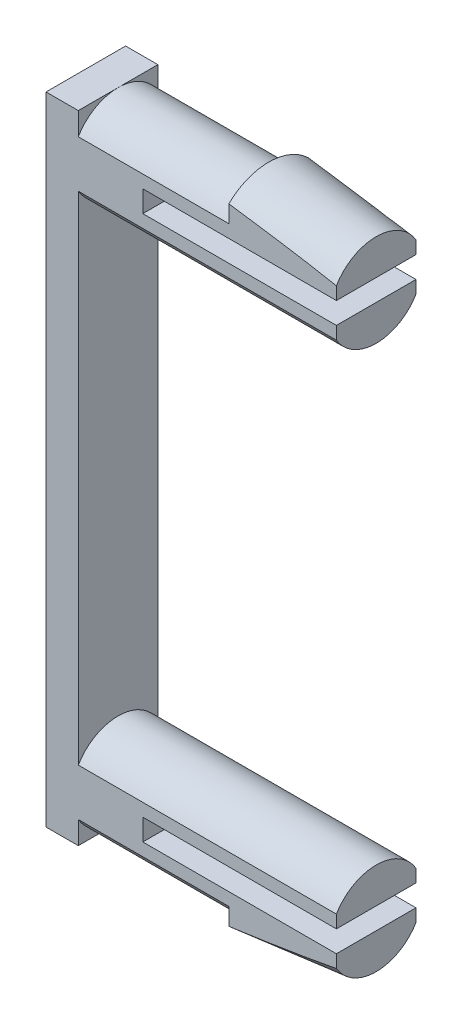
ISO-10303-21;
HEADER;
FILE_DESCRIPTION(('STEP AP214'),'2;1');
FILE_NAME('part.step','',(''),(''),'','','');
FILE_SCHEMA(('AUTOMOTIVE_DESIGN { 1 0 10303 214 1 1 1 1 }'));
ENDSEC;
DATA;
#1=APPLICATION_CONTEXT('core data for automotive mechanical design processes');
#2=APPLICATION_PROTOCOL_DEFINITION('international standard','automotive_design',2000,#1);
#3=PRODUCT_CONTEXT('',#1,'mechanical');
#4=PRODUCT('Part','Part','',(#3));
#5=PRODUCT_RELATED_PRODUCT_CATEGORY('part','',(#4));
#6=PRODUCT_DEFINITION_FORMATION('','',#4);
#7=PRODUCT_DEFINITION_CONTEXT('part definition',#1,'design');
#8=PRODUCT_DEFINITION('design','',#6,#7);
#9=PRODUCT_DEFINITION_SHAPE('','',#8);
#10=(LENGTH_UNIT() NAMED_UNIT(*) SI_UNIT(.MILLI.,.METRE.));
#11=(NAMED_UNIT(*) PLANE_ANGLE_UNIT() SI_UNIT($,.RADIAN.));
#12=(NAMED_UNIT(*) SI_UNIT($,.STERADIAN.) SOLID_ANGLE_UNIT());
#13=UNCERTAINTY_MEASURE_WITH_UNIT(LENGTH_MEASURE(1.E-05),#10,'distance_accuracy_value','');
#14=(GEOMETRIC_REPRESENTATION_CONTEXT(3) GLOBAL_UNCERTAINTY_ASSIGNED_CONTEXT((#13)) GLOBAL_UNIT_ASSIGNED_CONTEXT((#10,
#11,#12)) REPRESENTATION_CONTEXT('',''));
#15=CARTESIAN_POINT('',(0.,0.,0.));
#16=DIRECTION('',(0.,0.,1.));
#17=DIRECTION('',(1.,0.,0.));
#18=AXIS2_PLACEMENT_3D('',#15,#16,#17);
#19=CARTESIAN_POINT('',(12.75,-12.65,12.65));
#20=DIRECTION('',(1.,0.,0.));
#21=DIRECTION('',(0.,0.,-1.));
#22=AXIS2_PLACEMENT_3D('',#19,#20,#21);
#23=PLANE('',#22);
#24=DIRECTION('',(0.,0.,-1.));
#25=VECTOR('',#24,1.);
#26=CARTESIAN_POINT('',(12.75,-12.15,1.85100000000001));
#27=LINE('',#26,#25);
#28=CARTESIAN_POINT('',(12.75,-12.15,1.85));
#29=VERTEX_POINT('',#28);
#30=CARTESIAN_POINT('',(12.75,-12.15,-1.84999999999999));
#31=VERTEX_POINT('',#30);
#32=EDGE_CURVE('E215',#29,#31,#27,.T.);
#33=ORIENTED_EDGE('',*,*,#32,.T.);
#34=DIRECTION('',(0.,-1.,0.));
#35=VECTOR('',#34,1.);
#36=CARTESIAN_POINT('',(12.75,0.,-1.85));
#37=LINE('',#36,#35);
#38=CARTESIAN_POINT('',(12.75,-11.5545548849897,-1.84999999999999));
#39=VERTEX_POINT('',#38);
#40=EDGE_CURVE('E279',#39,#31,#37,.T.);
#41=ORIENTED_EDGE('',*,*,#40,.F.);
#42=CARTESIAN_POINT('',(12.75,-12.65,0.));
#43=DIRECTION('',(-1.,0.,0.));
#44=DIRECTION('',(0.,0.,1.));
#45=AXIS2_PLACEMENT_3D('',#42,#43,#44);
#46=CIRCLE('',#45,2.15);
#47=CARTESIAN_POINT('',(12.75,-11.5545548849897,1.85));
#48=VERTEX_POINT('',#47);
#49=EDGE_CURVE('E328',#48,#39,#46,.T.);
#50=ORIENTED_EDGE('',*,*,#49,.F.);
#51=DIRECTION('',(0.,-1.,0.));
#52=VECTOR('',#51,1.);
#53=CARTESIAN_POINT('',(12.75,0.,1.85));
#54=LINE('',#53,#52);
#55=EDGE_CURVE('E228',#48,#29,#54,.T.);
#56=ORIENTED_EDGE('',*,*,#55,.T.);
#57=EDGE_LOOP('',(#33,#41,#50,#56));
#58=FACE_BOUND('',#57,.T.);
#59=ADVANCED_FACE('F35',(#58),#23,.T.);
#60=CARTESIAN_POINT('',(12.75,12.65,-12.65));
#61=DIRECTION('',(1.,0.,0.));
#62=DIRECTION('',(0.,1.,0.));
#63=AXIS2_PLACEMENT_3D('',#60,#61,#62);
#64=PLANE('',#63);
#65=DIRECTION('',(0.,0.,-1.));
#66=VECTOR('',#65,1.);
#67=CARTESIAN_POINT('',(12.75,13.15,1.851));
#68=LINE('',#67,#66);
#69=CARTESIAN_POINT('',(12.75,13.15,1.85));
#70=VERTEX_POINT('',#69);
#71=CARTESIAN_POINT('',(12.75,13.15,-1.85));
#72=VERTEX_POINT('',#71);
#73=EDGE_CURVE('E431',#70,#72,#68,.T.);
#74=ORIENTED_EDGE('',*,*,#73,.T.);
#75=CARTESIAN_POINT('',(12.75,13.7454451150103,-1.85));
#76=VERTEX_POINT('',#75);
#77=EDGE_CURVE('E394',#76,#72,#37,.T.);
#78=ORIENTED_EDGE('',*,*,#77,.F.);
#79=CARTESIAN_POINT('',(12.75,12.65,0.));
#80=DIRECTION('',(-1.,0.,0.));
#81=DIRECTION('',(0.,-1.,0.));
#82=AXIS2_PLACEMENT_3D('',#79,#80,#81);
#83=CIRCLE('',#82,2.15);
#84=CARTESIAN_POINT('',(12.75,13.7454451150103,1.85));
#85=VERTEX_POINT('',#84);
#86=EDGE_CURVE('E334',#85,#76,#83,.T.);
#87=ORIENTED_EDGE('',*,*,#86,.F.);
#88=EDGE_CURVE('E233',#85,#70,#54,.T.);
#89=ORIENTED_EDGE('',*,*,#88,.T.);
#90=EDGE_LOOP('',(#74,#78,#87,#89));
#91=FACE_BOUND('',#90,.T.);
#92=ADVANCED_FACE('F430',(#91),#64,.T.);
#93=CARTESIAN_POINT('',(0.75,0.,2.25));
#94=DIRECTION('',(1.,0.,0.));
#95=DIRECTION('',(0.,1.,0.));
#96=AXIS2_PLACEMENT_3D('',#93,#94,#95);
#97=PLANE('',#96);
#98=DIRECTION('',(0.,1.,0.));
#99=VECTOR('',#98,1.);
#100=CARTESIAN_POINT('',(0.75,0.,1.85));
#101=LINE('',#100,#99);
#102=CARTESIAN_POINT('',(0.750000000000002,-14.8,1.85));
#103=VERTEX_POINT('',#102);
#104=CARTESIAN_POINT('',(0.750000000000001,-13.7454451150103,1.85));
#105=VERTEX_POINT('',#104);
#106=EDGE_CURVE('E259',#103,#105,#101,.T.);
#107=ORIENTED_EDGE('',*,*,#106,.F.);
#108=DIRECTION('',(0.,0.,-1.));
#109=VECTOR('',#108,1.);
#110=CARTESIAN_POINT('',(0.750000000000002,-14.8,2.25));
#111=LINE('',#110,#109);
#112=CARTESIAN_POINT('',(0.750000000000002,-14.8,0.));
#113=VERTEX_POINT('',#112);
#114=EDGE_CURVE('E346',#103,#113,#111,.T.);
#115=ORIENTED_EDGE('',*,*,#114,.T.);
#116=CARTESIAN_POINT('',(0.750000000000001,-12.65,0.));
#117=DIRECTION('',(-1.,0.,0.));
#118=DIRECTION('',(0.,0.,1.));
#119=AXIS2_PLACEMENT_3D('',#116,#117,#118);
#120=CIRCLE('',#119,2.15);
#121=EDGE_CURVE('E325',#113,#105,#120,.T.);
#122=ORIENTED_EDGE('',*,*,#121,.T.);
#123=EDGE_LOOP('',(#107,#115,#122));
#124=FACE_BOUND('',#123,.T.);
#125=ADVANCED_FACE('F486',(#124),#97,.T.);
#126=CARTESIAN_POINT('',(0.750000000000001,-11.5545548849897,1.85));
#127=VERTEX_POINT('',#126);
#128=CARTESIAN_POINT('',(0.749999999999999,11.5545548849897,1.85));
#129=VERTEX_POINT('',#128);
#130=EDGE_CURVE('E263',#127,#129,#101,.T.);
#131=ORIENTED_EDGE('',*,*,#130,.F.);
#132=CARTESIAN_POINT('',(0.750000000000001,-11.5545548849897,-1.84999999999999));
#133=VERTEX_POINT('',#132);
#134=EDGE_CURVE('E329',#127,#133,#120,.T.);
#135=ORIENTED_EDGE('',*,*,#134,.T.);
#136=DIRECTION('',(0.,1.,0.));
#137=VECTOR('',#136,1.);
#138=CARTESIAN_POINT('',(0.75,0.,-1.85));
#139=LINE('',#138,#137);
#140=CARTESIAN_POINT('',(0.749999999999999,11.5545548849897,-1.85));
#141=VERTEX_POINT('',#140);
#142=EDGE_CURVE('E378',#133,#141,#139,.T.);
#143=ORIENTED_EDGE('',*,*,#142,.T.);
#144=CARTESIAN_POINT('',(0.749999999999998,12.65,0.));
#145=DIRECTION('',(-1.,0.,0.));
#146=DIRECTION('',(0.,-1.,0.));
#147=AXIS2_PLACEMENT_3D('',#144,#145,#146);
#148=CIRCLE('',#147,2.15000000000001);
#149=EDGE_CURVE('E340',#141,#129,#148,.T.);
#150=ORIENTED_EDGE('',*,*,#149,.T.);
#151=EDGE_LOOP('',(#131,#135,#143,#150));
#152=FACE_BOUND('',#151,.T.);
#153=ADVANCED_FACE('F413',(#152),#97,.T.);
#154=CARTESIAN_POINT('',(0.749999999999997,12.65,0.));
#155=DIRECTION('',(-1.,0.,0.));
#156=DIRECTION('',(0.,-1.,0.));
#157=AXIS2_PLACEMENT_3D('',#154,#155,#156);
#158=CYLINDRICAL_SURFACE('',#157,2.15);
#159=DIRECTION('',(-1.,0.,0.));
#160=VECTOR('',#159,1.);
#161=CARTESIAN_POINT('',(0.749999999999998,11.5545548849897,1.85));
#162=LINE('',#161,#160);
#163=CARTESIAN_POINT('',(12.75,11.5545548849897,1.85));
#164=VERTEX_POINT('',#163);
#165=EDGE_CURVE('E265',#129,#164,#162,.F.);
#166=ORIENTED_EDGE('',*,*,#165,.F.);
#167=ORIENTED_EDGE('',*,*,#149,.F.);
#168=DIRECTION('',(-1.,0.,0.));
#169=VECTOR('',#168,1.);
#170=CARTESIAN_POINT('',(0.749999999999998,11.5545548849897,-1.85));
#171=LINE('',#170,#169);
#172=CARTESIAN_POINT('',(12.75,11.5545548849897,-1.85));
#173=VERTEX_POINT('',#172);
#174=EDGE_CURVE('E376',#141,#173,#171,.F.);
#175=ORIENTED_EDGE('',*,*,#174,.T.);
#176=CARTESIAN_POINT('',(12.75,12.65,0.));
#177=DIRECTION('',(-1.,0.,0.));
#178=DIRECTION('',(0.,-1.,0.));
#179=AXIS2_PLACEMENT_3D('',#176,#177,#178);
#180=CIRCLE('',#179,2.15);
#181=EDGE_CURVE('E331',#173,#164,#180,.T.);
#182=ORIENTED_EDGE('',*,*,#181,.T.);
#183=EDGE_LOOP('',(#166,#167,#175,#182));
#184=FACE_BOUND('',#183,.T.);
#185=ADVANCED_FACE('F411',(#184),#158,.T.);
#186=CARTESIAN_POINT('',(0.750000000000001,-12.65,0.));
#187=DIRECTION('',(-1.,0.,0.));
#188=DIRECTION('',(0.,0.,1.));
#189=AXIS2_PLACEMENT_3D('',#186,#187,#188);
#190=CYLINDRICAL_SURFACE('',#189,2.15);
#191=DIRECTION('',(-1.,0.,0.));
#192=VECTOR('',#191,1.);
#193=CARTESIAN_POINT('',(0.750000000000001,-13.7454451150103,1.85));
#194=LINE('',#193,#192);
#195=CARTESIAN_POINT('',(7.75,-13.7454451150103,1.85));
#196=VERTEX_POINT('',#195);
#197=EDGE_CURVE('E257',#105,#196,#194,.F.);
#198=ORIENTED_EDGE('',*,*,#197,.F.);
#199=ORIENTED_EDGE('',*,*,#121,.F.);
#200=CARTESIAN_POINT('',(0.750000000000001,-13.7454451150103,-1.84999999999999));
#201=VERTEX_POINT('',#200);
#202=EDGE_CURVE('E324',#201,#113,#120,.T.);
#203=ORIENTED_EDGE('',*,*,#202,.F.);
#204=DIRECTION('',(-1.,0.,0.));
#205=VECTOR('',#204,1.);
#206=CARTESIAN_POINT('',(0.750000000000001,-13.7454451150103,-1.84999999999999));
#207=LINE('',#206,#205);
#208=CARTESIAN_POINT('',(7.75,-13.7454451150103,-1.84999999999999));
#209=VERTEX_POINT('',#208);
#210=EDGE_CURVE('E387',#201,#209,#207,.F.);
#211=ORIENTED_EDGE('',*,*,#210,.T.);
#212=CARTESIAN_POINT('',(7.75,-12.65,0.));
#213=DIRECTION('',(-1.,0.,0.));
#214=DIRECTION('',(0.,0.,1.));
#215=AXIS2_PLACEMENT_3D('',#212,#213,#214);
#216=CIRCLE('',#215,2.15);
#217=EDGE_CURVE('E316',#209,#196,#216,.T.);
#218=ORIENTED_EDGE('',*,*,#217,.T.);
#219=EDGE_LOOP('',(#198,#199,#203,#211,#218));
#220=FACE_BOUND('',#219,.T.);
#221=ADVANCED_FACE('F493',(#220),#190,.T.);
#222=CARTESIAN_POINT('',(0.750000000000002,-14.8,-1.85));
#223=VERTEX_POINT('',#222);
#224=EDGE_CURVE('E345',#113,#223,#111,.T.);
#225=ORIENTED_EDGE('',*,*,#224,.T.);
#226=EDGE_CURVE('E384',#223,#201,#139,.T.);
#227=ORIENTED_EDGE('',*,*,#226,.T.);
#228=ORIENTED_EDGE('',*,*,#202,.T.);
#229=EDGE_LOOP('',(#225,#227,#228));
#230=FACE_BOUND('',#229,.T.);
#231=ADVANCED_FACE('F37',(#230),#97,.T.);
#232=CARTESIAN_POINT('',(0.749999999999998,13.7454451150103,1.85));
#233=VERTEX_POINT('',#232);
#234=CARTESIAN_POINT('',(0.749999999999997,14.8,1.85));
#235=VERTEX_POINT('',#234);
#236=EDGE_CURVE('E262',#233,#235,#101,.T.);
#237=ORIENTED_EDGE('',*,*,#236,.F.);
#238=CARTESIAN_POINT('',(0.749999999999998,14.8,0.));
#239=VERTEX_POINT('',#238);
#240=EDGE_CURVE('E341',#233,#239,#148,.T.);
#241=ORIENTED_EDGE('',*,*,#240,.T.);
#242=DIRECTION('',(0.,0.,-1.));
#243=VECTOR('',#242,1.);
#244=CARTESIAN_POINT('',(0.749999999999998,14.8,2.25));
#245=LINE('',#244,#243);
#246=EDGE_CURVE('E352',#235,#239,#245,.T.);
#247=ORIENTED_EDGE('',*,*,#246,.F.);
#248=EDGE_LOOP('',(#237,#241,#247));
#249=FACE_BOUND('',#248,.T.);
#250=ADVANCED_FACE('F513',(#249),#97,.T.);
#251=CARTESIAN_POINT('',(0.749999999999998,13.7454451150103,-1.85));
#252=VERTEX_POINT('',#251);
#253=EDGE_CURVE('E337',#239,#252,#148,.T.);
#254=ORIENTED_EDGE('',*,*,#253,.T.);
#255=CARTESIAN_POINT('',(0.749999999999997,14.8,-1.85));
#256=VERTEX_POINT('',#255);
#257=EDGE_CURVE('E313',#252,#256,#139,.T.);
#258=ORIENTED_EDGE('',*,*,#257,.T.);
#259=EDGE_CURVE('E351',#239,#256,#245,.T.);
#260=ORIENTED_EDGE('',*,*,#259,.F.);
#261=EDGE_LOOP('',(#254,#258,#260));
#262=FACE_BOUND('',#261,.T.);
#263=ADVANCED_FACE('F365',(#262),#97,.T.);
#264=CARTESIAN_POINT('',(0.,14.8,2.25));
#265=DIRECTION('',(0.,1.,0.));
#266=DIRECTION('',(-1.,0.,0.));
#267=AXIS2_PLACEMENT_3D('',#264,#265,#266);
#268=PLANE('',#267);
#269=DIRECTION('',(-1.,0.,0.));
#270=VECTOR('',#269,1.);
#271=CARTESIAN_POINT('',(12.75,14.8,1.85));
#272=LINE('',#271,#270);
#273=CARTESIAN_POINT('',(-0.750000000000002,14.8,1.85));
#274=VERTEX_POINT('',#273);
#275=EDGE_CURVE('E243',#235,#274,#272,.T.);
#276=ORIENTED_EDGE('',*,*,#275,.F.);
#277=ORIENTED_EDGE('',*,*,#246,.T.);
#278=ORIENTED_EDGE('',*,*,#259,.T.);
#279=DIRECTION('',(-1.,0.,0.));
#280=VECTOR('',#279,1.);
#281=CARTESIAN_POINT('',(12.75,14.8,-1.85));
#282=LINE('',#281,#280);
#283=CARTESIAN_POINT('',(-0.750000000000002,14.8,-1.85));
#284=VERTEX_POINT('',#283);
#285=EDGE_CURVE('E361',#256,#284,#282,.T.);
#286=ORIENTED_EDGE('',*,*,#285,.T.);
#287=DIRECTION('',(0.,0.,-1.));
#288=VECTOR('',#287,1.);
#289=CARTESIAN_POINT('',(-0.750000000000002,14.8,2.25));
#290=LINE('',#289,#288);
#291=EDGE_CURVE('E350',#274,#284,#290,.T.);
#292=ORIENTED_EDGE('',*,*,#291,.F.);
#293=EDGE_LOOP('',(#276,#277,#278,#286,#292));
#294=FACE_BOUND('',#293,.T.);
#295=ADVANCED_FACE('F359',(#294),#268,.T.);
#296=CARTESIAN_POINT('',(-0.75,0.,2.25));
#297=DIRECTION('',(1.,0.,0.));
#298=DIRECTION('',(0.,1.,0.));
#299=AXIS2_PLACEMENT_3D('',#296,#297,#298);
#300=PLANE('',#299);
#301=DIRECTION('',(0.,0.,-1.));
#302=VECTOR('',#301,1.);
#303=CARTESIAN_POINT('',(-0.749999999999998,-14.8,2.25));
#304=LINE('',#303,#302);
#305=CARTESIAN_POINT('',(-0.749999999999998,-14.8,1.85));
#306=VERTEX_POINT('',#305);
#307=CARTESIAN_POINT('',(-0.749999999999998,-14.8,-1.85));
#308=VERTEX_POINT('',#307);
#309=EDGE_CURVE('E348',#306,#308,#304,.T.);
#310=ORIENTED_EDGE('',*,*,#309,.F.);
#311=DIRECTION('',(0.,-1.,0.));
#312=VECTOR('',#311,1.);
#313=CARTESIAN_POINT('',(-0.75,0.,1.85));
#314=LINE('',#313,#312);
#315=EDGE_CURVE('E229',#274,#306,#314,.T.);
#316=ORIENTED_EDGE('',*,*,#315,.F.);
#317=ORIENTED_EDGE('',*,*,#291,.T.);
#318=DIRECTION('',(0.,-1.,0.));
#319=VECTOR('',#318,1.);
#320=CARTESIAN_POINT('',(-0.75,0.,-1.85));
#321=LINE('',#320,#319);
#322=EDGE_CURVE('E396',#284,#308,#321,.T.);
#323=ORIENTED_EDGE('',*,*,#322,.T.);
#324=EDGE_LOOP('',(#310,#316,#317,#323));
#325=FACE_BOUND('',#324,.T.);
#326=ADVANCED_FACE('F506',(#325),#300,.F.);
#327=CARTESIAN_POINT('',(0.,-14.8,2.25));
#328=DIRECTION('',(0.,1.,0.));
#329=DIRECTION('',(0.,0.,1.));
#330=AXIS2_PLACEMENT_3D('',#327,#328,#329);
#331=PLANE('',#330);
#332=ORIENTED_EDGE('',*,*,#114,.F.);
#333=DIRECTION('',(-1.,0.,0.));
#334=VECTOR('',#333,1.);
#335=CARTESIAN_POINT('',(12.75,-14.8,1.85));
#336=LINE('',#335,#334);
#337=EDGE_CURVE('E247',#103,#306,#336,.T.);
#338=ORIENTED_EDGE('',*,*,#337,.T.);
#339=ORIENTED_EDGE('',*,*,#309,.T.);
#340=DIRECTION('',(-1.,0.,0.));
#341=VECTOR('',#340,1.);
#342=CARTESIAN_POINT('',(12.75,-14.8,-1.85));
#343=LINE('',#342,#341);
#344=EDGE_CURVE('E392',#223,#308,#343,.T.);
#345=ORIENTED_EDGE('',*,*,#344,.F.);
#346=ORIENTED_EDGE('',*,*,#224,.F.);
#347=EDGE_LOOP('',(#332,#338,#339,#345,#346));
#348=FACE_BOUND('',#347,.T.);
#349=ADVANCED_FACE('F503',(#348),#331,.F.);
#350=CARTESIAN_POINT('',(12.75,12.65,0.));
#351=DIRECTION('',(-1.,0.,0.));
#352=DIRECTION('',(0.,-1.,0.));
#353=AXIS2_PLACEMENT_3D('',#350,#351,#352);
#354=CONICAL_SURFACE('',#353,2.15,0.0996686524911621);
#355=CARTESIAN_POINT('',(7.75,12.65,0.));
#356=DIRECTION('',(-1.,0.,0.));
#357=DIRECTION('',(0.,-1.,0.));
#358=AXIS2_PLACEMENT_3D('',#355,#356,#357);
#359=CIRCLE('',#358,2.65);
#360=CARTESIAN_POINT('',(7.75,14.547366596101,1.85));
#361=VERTEX_POINT('',#360);
#362=CARTESIAN_POINT('',(7.75,14.547366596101,-1.85));
#363=VERTEX_POINT('',#362);
#364=EDGE_CURVE('E343',#361,#363,#359,.T.);
#365=ORIENTED_EDGE('',*,*,#364,.F.);
#366=CARTESIAN_POINT('',(4.48420663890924,14.9818500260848,1.85));
#367=CARTESIAN_POINT('',(4.93703514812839,14.9240127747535,1.85));
#368=CARTESIAN_POINT('',(5.38977022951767,14.8654217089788,1.85));
#369=CARTESIAN_POINT('',(6.29511848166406,14.7461405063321,1.85));
#370=CARTESIAN_POINT('',(6.7477315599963,14.6854496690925,1.85));
#371=CARTESIAN_POINT('',(7.64198380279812,14.5628702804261,1.85));
#372=CARTESIAN_POINT('',(8.08363136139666,14.5010432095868,1.85));
#373=CARTESIAN_POINT('',(8.96630999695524,14.3740211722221,1.85));
#374=CARTESIAN_POINT('',(9.40734121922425,14.3088272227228,1.85));
#375=CARTESIAN_POINT('',(10.166973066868,14.1923336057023,1.85));
#376=CARTESIAN_POINT('',(10.4857469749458,14.1421692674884,1.85));
#377=CARTESIAN_POINT('',(11.1229933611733,14.0384387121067,1.85));
#378=CARTESIAN_POINT('',(11.4414654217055,13.9848699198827,1.85));
#379=CARTESIAN_POINT('',(12.0838595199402,13.8719280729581,1.85));
#380=CARTESIAN_POINT('',(12.4077654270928,13.8124615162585,1.85));
#381=CARTESIAN_POINT('',(12.8921210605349,13.7176206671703,1.85));
#382=CARTESIAN_POINT('',(13.0531291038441,13.6851094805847,1.85));
#383=CARTESIAN_POINT('',(13.3746030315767,13.6175780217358,1.85));
#384=CARTESIAN_POINT('',(13.5350689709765,13.5825580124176,1.85));
#385=CARTESIAN_POINT('',(13.856977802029,13.5087092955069,1.85));
#386=CARTESIAN_POINT('',(14.0184122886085,13.4698432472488,1.85));
#387=CARTESIAN_POINT('',(14.2601362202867,13.4075033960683,1.85));
#388=CARTESIAN_POINT('',(14.3409237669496,13.3859667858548,1.85));
#389=CARTESIAN_POINT('',(14.5019803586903,13.3412166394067,1.85));
#390=CARTESIAN_POINT('',(14.5822497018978,13.3180041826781,1.85));
#391=CARTESIAN_POINT('',(14.7401303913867,13.2699629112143,1.85));
#392=CARTESIAN_POINT('',(14.817758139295,13.24518876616,1.85));
#393=CARTESIAN_POINT('',(14.9722036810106,13.1926471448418,1.85));
#394=CARTESIAN_POINT('',(15.0490191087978,13.1648726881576,1.85));
#395=CARTESIAN_POINT('',(15.2001324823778,13.1053198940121,1.85));
#396=CARTESIAN_POINT('',(15.2744493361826,13.073592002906,1.85));
#397=CARTESIAN_POINT('',(15.3831582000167,13.0206283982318,1.85));
#398=CARTESIAN_POINT('',(15.418868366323,13.002118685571,1.85));
#399=CARTESIAN_POINT('',(15.488841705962,12.9625636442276,1.85));
#400=CARTESIAN_POINT('',(15.5231069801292,12.9415221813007,1.85));
#401=CARTESIAN_POINT('',(15.5673919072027,12.9106874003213,1.85));
#402=CARTESIAN_POINT('',(15.57857195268,12.902569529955,1.85));
#403=CARTESIAN_POINT('',(15.6005244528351,12.8857935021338,1.85));
#404=CARTESIAN_POINT('',(15.6112966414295,12.8771350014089,1.85));
#405=CARTESIAN_POINT('',(15.6427595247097,12.8502816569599,1.85));
#406=CARTESIAN_POINT('',(15.6627007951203,12.8311393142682,1.85));
#407=CARTESIAN_POINT('',(15.6900199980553,12.7994759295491,1.85));
#408=CARTESIAN_POINT('',(15.6988279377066,12.788197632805,1.85));
#409=CARTESIAN_POINT('',(15.7149279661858,12.7645770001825,1.85));
#410=CARTESIAN_POINT('',(15.7222203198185,12.7522348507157,1.85));
#411=CARTESIAN_POINT('',(15.73350902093,12.7288328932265,1.85));
#412=CARTESIAN_POINT('',(15.7378638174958,12.717949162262,1.85));
#413=CARTESIAN_POINT('',(15.7447119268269,12.6956157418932,1.85));
#414=CARTESIAN_POINT('',(15.7472088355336,12.6841671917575,1.85));
#415=CARTESIAN_POINT('',(15.7500452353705,12.6609112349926,1.85));
#416=CARTESIAN_POINT('',(15.750368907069,12.6491018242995,1.85));
#417=CARTESIAN_POINT('',(15.748768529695,12.6256334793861,1.85));
#418=CARTESIAN_POINT('',(15.7468426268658,12.6139746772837,1.85));
#419=CARTESIAN_POINT('',(15.7406258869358,12.5897075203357,1.85));
#420=CARTESIAN_POINT('',(15.7360617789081,12.5771709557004,1.85));
#421=CARTESIAN_POINT('',(15.7249821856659,12.5529978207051,1.85));
#422=CARTESIAN_POINT('',(15.7184628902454,12.5413630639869,1.85));
#423=CARTESIAN_POINT('',(15.6990467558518,12.5113082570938,1.85));
#424=CARTESIAN_POINT('',(15.6848517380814,12.4937403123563,1.85));
#425=CARTESIAN_POINT('',(15.6541778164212,12.4607495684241,1.85));
#426=CARTESIAN_POINT('',(15.6376917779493,12.4453337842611,1.85));
#427=CARTESIAN_POINT('',(15.5937539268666,12.4079905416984,1.85));
#428=CARTESIAN_POINT('',(15.5653198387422,12.3872344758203,1.85));
#429=CARTESIAN_POINT('',(15.5066781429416,12.3483602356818,1.85));
#430=CARTESIAN_POINT('',(15.4764662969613,12.3302487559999,1.85));
#431=CARTESIAN_POINT('',(15.4148027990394,12.2958325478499,1.85));
#432=CARTESIAN_POINT('',(15.3833448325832,12.2795392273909,1.85));
#433=CARTESIAN_POINT('',(15.3197707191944,12.2484214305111,1.85));
#434=CARTESIAN_POINT('',(15.2876554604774,12.2335951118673,1.85));
#435=CARTESIAN_POINT('',(15.1810564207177,12.1865601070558,1.85));
#436=CARTESIAN_POINT('',(15.10554324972,12.1566949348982,1.85));
#437=CARTESIAN_POINT('',(14.953180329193,12.1005599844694,1.85));
#438=CARTESIAN_POINT('',(14.8763296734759,12.074292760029,1.85));
#439=CARTESIAN_POINT('',(14.644247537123,11.9991006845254,1.85));
#440=CARTESIAN_POINT('',(14.4878118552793,11.9539146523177,1.85));
#441=CARTESIAN_POINT('',(14.1735759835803,11.8692135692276,1.85));
#442=CARTESIAN_POINT('',(14.0157766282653,11.8296952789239,1.85));
#443=CARTESIAN_POINT('',(13.6994949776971,11.7545131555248,1.85));
#444=CARTESIAN_POINT('',(13.5410139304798,11.7188440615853,1.85));
#445=CARTESIAN_POINT('',(13.2247887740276,11.6504999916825,1.85));
#446=CARTESIAN_POINT('',(13.0670494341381,11.6178026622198,1.85));
#447=CARTESIAN_POINT('',(12.7511616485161,11.5544400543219,1.85));
#448=CARTESIAN_POINT('',(12.5930131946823,11.5237748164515,1.85));
#449=CARTESIAN_POINT('',(12.1180877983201,11.4341453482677,1.85));
#450=CARTESIAN_POINT('',(11.8008641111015,11.3775543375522,1.85));
#451=CARTESIAN_POINT('',(11.1654273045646,11.2685454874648,1.85));
#452=CARTESIAN_POINT('',(10.8472135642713,11.2161313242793,1.85));
#453=CARTESIAN_POINT('',(10.2103158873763,11.1143771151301,1.85));
#454=CARTESIAN_POINT('',(9.89163197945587,11.0650368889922,1.85));
#455=CARTESIAN_POINT('',(9.25431052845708,10.9687374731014,1.85));
#456=CARTESIAN_POINT('',(8.93567341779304,10.9217754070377,1.85));
#457=CARTESIAN_POINT('',(8.29813231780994,10.8296718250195,1.85));
#458=CARTESIAN_POINT('',(7.97922832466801,10.7845303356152,1.85));
#459=CARTESIAN_POINT('',(7.02240473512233,10.6513097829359,1.85));
#460=CARTESIAN_POINT('',(6.38418214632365,10.565406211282,1.85));
#461=CARTESIAN_POINT('',(5.53551585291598,10.4538605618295,1.85));
#462=CARTESIAN_POINT('',(5.32530131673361,10.426449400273,1.85));
#463=CARTESIAN_POINT('',(4.90480103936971,10.3720164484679,1.85));
#464=CARTESIAN_POINT('',(4.69451529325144,10.344994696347,1.85));
#465=CARTESIAN_POINT('',(4.48420663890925,10.3181499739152,1.85));
#466=B_SPLINE_CURVE_WITH_KNOTS('',3,(#366,#367,#368,#369,#370,#371,#372,#373,#374,#375,#376,
#377,#378,#379,#380,#381,#382,#383,#384,#385,#386,#387,#388,#389,#390,#391,#392,#393,#394,#395,
#396,#397,#398,#399,#400,#401,#402,#403,#404,#405,#406,#407,#408,#409,#410,#411,#412,#413,#414,
#415,#416,#417,#418,#419,#420,#421,#422,#423,#424,#425,#426,#427,#428,#429,#430,#431,#432,#433,
#434,#435,#436,#437,#438,#439,#440,#441,#442,#443,#444,#445,#446,#447,#448,#449,#450,#451,#452,
#453,#454,#455,#456,#457,#458,#459,#460,#461,#462,#463,#464,#465),.UNSPECIFIED.,.F.,.F.,(4,2,2,
2,2,2,2,2,2,2,2,2,2,2,2,2,2,2,2,2,2,2,2,2,2,2,2,2,2,2,2,2,2,2,2,2,2,2,2,2,2,2,2,2,2,2,2,2,2,4),
(0.,1.36952523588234,2.73951175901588,4.07736527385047,5.41481700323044,6.38289385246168,
7.35171185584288,8.33960181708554,8.83235954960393,9.32506571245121,9.82314020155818,
10.0739532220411,10.3246060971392,10.5690149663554,10.8140052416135,11.056139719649,
11.1767508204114,11.297180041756,11.3386126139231,11.3800717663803,11.462615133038,
11.5054635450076,11.5483044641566,11.5833397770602,11.6183071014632,11.6535286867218,
11.6887793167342,11.7285818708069,11.7684625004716,11.8358377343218,11.9034276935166,
12.008764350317,12.1143632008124,12.2205912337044,12.3266841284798,12.5701146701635,
12.8137171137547,13.3019716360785,13.7899459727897,14.2772446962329,14.7605070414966,
15.2437790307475,16.2104250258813,17.1779126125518,18.1453434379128,19.1115747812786,
20.0778202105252,22.0097306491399,22.6457131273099,23.2817574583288),.UNSPECIFIED.);
#467=EDGE_CURVE('E272',#361,#85,#466,.T.);
#468=ORIENTED_EDGE('',*,*,#467,.T.);
#469=ORIENTED_EDGE('',*,*,#86,.T.);
#470=CARTESIAN_POINT('',(4.48420663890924,14.9818500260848,-1.85));
#471=CARTESIAN_POINT('',(4.93703514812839,14.9240127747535,-1.85));
#472=CARTESIAN_POINT('',(5.38977022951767,14.8654217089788,-1.85));
#473=CARTESIAN_POINT('',(6.29511848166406,14.7461405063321,-1.85));
#474=CARTESIAN_POINT('',(6.7477315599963,14.6854496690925,-1.85));
#475=CARTESIAN_POINT('',(7.64198380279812,14.5628702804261,-1.85));
#476=CARTESIAN_POINT('',(8.08363136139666,14.5010432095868,-1.85));
#477=CARTESIAN_POINT('',(8.96630999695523,14.3740211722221,-1.85));
#478=CARTESIAN_POINT('',(9.40734121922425,14.3088272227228,-1.85));
#479=CARTESIAN_POINT('',(10.166973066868,14.1923336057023,-1.85));
#480=CARTESIAN_POINT('',(10.4857469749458,14.1421692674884,-1.85));
#481=CARTESIAN_POINT('',(11.1229933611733,14.0384387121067,-1.85));
#482=CARTESIAN_POINT('',(11.4414654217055,13.9848699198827,-1.85));
#483=CARTESIAN_POINT('',(12.0838595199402,13.8719280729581,-1.85));
#484=CARTESIAN_POINT('',(12.4077654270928,13.8124615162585,-1.85));
#485=CARTESIAN_POINT('',(12.8921210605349,13.7176206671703,-1.85));
#486=CARTESIAN_POINT('',(13.0531291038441,13.6851094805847,-1.85));
#487=CARTESIAN_POINT('',(13.3746030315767,13.6175780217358,-1.85));
#488=CARTESIAN_POINT('',(13.5350689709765,13.5825580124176,-1.85));
#489=CARTESIAN_POINT('',(13.856977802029,13.5087092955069,-1.85));
#490=CARTESIAN_POINT('',(14.0184122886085,13.4698432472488,-1.85));
#491=CARTESIAN_POINT('',(14.2601362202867,13.4075033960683,-1.85));
#492=CARTESIAN_POINT('',(14.3409237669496,13.3859667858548,-1.85));
#493=CARTESIAN_POINT('',(14.5019803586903,13.3412166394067,-1.85));
#494=CARTESIAN_POINT('',(14.5822497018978,13.3180041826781,-1.85));
#495=CARTESIAN_POINT('',(14.7401303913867,13.2699629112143,-1.85));
#496=CARTESIAN_POINT('',(14.817758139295,13.24518876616,-1.85));
#497=CARTESIAN_POINT('',(14.9722036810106,13.1926471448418,-1.85));
#498=CARTESIAN_POINT('',(15.0490191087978,13.1648726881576,-1.85));
#499=CARTESIAN_POINT('',(15.2001324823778,13.1053198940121,-1.85));
#500=CARTESIAN_POINT('',(15.2744493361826,13.073592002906,-1.85));
#501=CARTESIAN_POINT('',(15.3831582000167,13.0206283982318,-1.85));
#502=CARTESIAN_POINT('',(15.418868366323,13.002118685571,-1.85));
#503=CARTESIAN_POINT('',(15.488841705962,12.9625636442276,-1.85));
#504=CARTESIAN_POINT('',(15.5231069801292,12.9415221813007,-1.85));
#505=CARTESIAN_POINT('',(15.5673919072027,12.9106874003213,-1.85));
#506=CARTESIAN_POINT('',(15.57857195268,12.902569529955,-1.85));
#507=CARTESIAN_POINT('',(15.6005244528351,12.8857935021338,-1.85));
#508=CARTESIAN_POINT('',(15.6112966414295,12.8771350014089,-1.85));
#509=CARTESIAN_POINT('',(15.6427595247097,12.8502816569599,-1.85));
#510=CARTESIAN_POINT('',(15.6627007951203,12.8311393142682,-1.85));
#511=CARTESIAN_POINT('',(15.6900199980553,12.7994759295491,-1.85));
#512=CARTESIAN_POINT('',(15.6988279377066,12.788197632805,-1.85));
#513=CARTESIAN_POINT('',(15.7149279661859,12.7645770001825,-1.85));
#514=CARTESIAN_POINT('',(15.7222203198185,12.7522348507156,-1.85));
#515=CARTESIAN_POINT('',(15.73350902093,12.7288328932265,-1.85));
#516=CARTESIAN_POINT('',(15.7378638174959,12.717949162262,-1.85));
#517=CARTESIAN_POINT('',(15.7447119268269,12.6956157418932,-1.85));
#518=CARTESIAN_POINT('',(15.7472088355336,12.6841671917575,-1.85));
#519=CARTESIAN_POINT('',(15.7500452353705,12.6609112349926,-1.85));
#520=CARTESIAN_POINT('',(15.750368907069,12.6491018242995,-1.85));
#521=CARTESIAN_POINT('',(15.748768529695,12.6256334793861,-1.85));
#522=CARTESIAN_POINT('',(15.7468426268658,12.6139746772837,-1.85));
#523=CARTESIAN_POINT('',(15.7406258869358,12.5897075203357,-1.85));
#524=CARTESIAN_POINT('',(15.7360617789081,12.5771709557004,-1.85));
#525=CARTESIAN_POINT('',(15.7249821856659,12.5529978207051,-1.85));
#526=CARTESIAN_POINT('',(15.7184628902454,12.5413630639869,-1.85));
#527=CARTESIAN_POINT('',(15.6990467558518,12.5113082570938,-1.85));
#528=CARTESIAN_POINT('',(15.6848517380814,12.4937403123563,-1.85));
#529=CARTESIAN_POINT('',(15.6541778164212,12.4607495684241,-1.85));
#530=CARTESIAN_POINT('',(15.6376917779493,12.4453337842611,-1.85));
#531=CARTESIAN_POINT('',(15.5937539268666,12.4079905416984,-1.85));
#532=CARTESIAN_POINT('',(15.5653198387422,12.3872344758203,-1.85));
#533=CARTESIAN_POINT('',(15.5066781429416,12.3483602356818,-1.85));
#534=CARTESIAN_POINT('',(15.4764662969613,12.3302487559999,-1.85));
#535=CARTESIAN_POINT('',(15.4148027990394,12.29583254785,-1.85));
#536=CARTESIAN_POINT('',(15.3833448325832,12.2795392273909,-1.85));
#537=CARTESIAN_POINT('',(15.3197707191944,12.2484214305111,-1.85));
#538=CARTESIAN_POINT('',(15.2876554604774,12.2335951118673,-1.85));
#539=CARTESIAN_POINT('',(15.1810564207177,12.1865601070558,-1.85));
#540=CARTESIAN_POINT('',(15.10554324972,12.1566949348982,-1.85));
#541=CARTESIAN_POINT('',(14.9531803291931,12.1005599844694,-1.85));
#542=CARTESIAN_POINT('',(14.876329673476,12.074292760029,-1.85));
#543=CARTESIAN_POINT('',(14.644247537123,11.9991006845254,-1.85));
#544=CARTESIAN_POINT('',(14.4878118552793,11.9539146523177,-1.85));
#545=CARTESIAN_POINT('',(14.1735759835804,11.8692135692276,-1.85));
#546=CARTESIAN_POINT('',(14.0157766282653,11.8296952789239,-1.85));
#547=CARTESIAN_POINT('',(13.6994949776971,11.7545131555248,-1.85));
#548=CARTESIAN_POINT('',(13.5410139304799,11.7188440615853,-1.85));
#549=CARTESIAN_POINT('',(13.2247887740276,11.6504999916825,-1.85));
#550=CARTESIAN_POINT('',(13.0670494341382,11.6178026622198,-1.85));
#551=CARTESIAN_POINT('',(12.7511616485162,11.5544400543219,-1.85));
#552=CARTESIAN_POINT('',(12.5930131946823,11.5237748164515,-1.85));
#553=CARTESIAN_POINT('',(12.1180877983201,11.4341453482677,-1.85));
#554=CARTESIAN_POINT('',(11.8008641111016,11.3775543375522,-1.85));
#555=CARTESIAN_POINT('',(11.1654273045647,11.2685454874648,-1.85));
#556=CARTESIAN_POINT('',(10.8472135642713,11.2161313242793,-1.85));
#557=CARTESIAN_POINT('',(10.2103158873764,11.1143771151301,-1.85));
#558=CARTESIAN_POINT('',(9.89163197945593,11.0650368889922,-1.85));
#559=CARTESIAN_POINT('',(9.25431052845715,10.9687374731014,-1.85));
#560=CARTESIAN_POINT('',(8.9356734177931,10.9217754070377,-1.85));
#561=CARTESIAN_POINT('',(8.29813231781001,10.8296718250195,-1.85));
#562=CARTESIAN_POINT('',(7.97922832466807,10.7845303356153,-1.85));
#563=CARTESIAN_POINT('',(7.02240473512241,10.6513097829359,-1.85));
#564=CARTESIAN_POINT('',(6.38418214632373,10.565406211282,-1.85));
#565=CARTESIAN_POINT('',(5.53551585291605,10.4538605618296,-1.85));
#566=CARTESIAN_POINT('',(5.32530131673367,10.426449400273,-1.85));
#567=CARTESIAN_POINT('',(4.90480103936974,10.3720164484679,-1.85));
#568=CARTESIAN_POINT('',(4.69451529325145,10.344994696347,-1.85));
#569=CARTESIAN_POINT('',(4.48420663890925,10.3181499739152,-1.85));
#570=B_SPLINE_CURVE_WITH_KNOTS('',3,(#470,#471,#472,#473,#474,#475,#476,#477,#478,#479,#480,
#481,#482,#483,#484,#485,#486,#487,#488,#489,#490,#491,#492,#493,#494,#495,#496,#497,#498,#499,
#500,#501,#502,#503,#504,#505,#506,#507,#508,#509,#510,#511,#512,#513,#514,#515,#516,#517,#518,
#519,#520,#521,#522,#523,#524,#525,#526,#527,#528,#529,#530,#531,#532,#533,#534,#535,#536,#537,
#538,#539,#540,#541,#542,#543,#544,#545,#546,#547,#548,#549,#550,#551,#552,#553,#554,#555,#556,
#557,#558,#559,#560,#561,#562,#563,#564,#565,#566,#567,#568,#569),.UNSPECIFIED.,.F.,.F.,(4,2,2,
2,2,2,2,2,2,2,2,2,2,2,2,2,2,2,2,2,2,2,2,2,2,2,2,2,2,2,2,2,2,2,2,2,2,2,2,2,2,2,2,2,2,2,2,2,2,4),
(0.,1.36952523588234,2.73951175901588,4.07736527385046,5.41481700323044,6.38289385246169,
7.35171185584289,8.33960181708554,8.83235954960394,9.32506571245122,9.82314020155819,
10.0739532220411,10.3246060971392,10.5690149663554,10.8140052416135,11.0561397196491,
11.1767508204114,11.297180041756,11.3386126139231,11.3800717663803,11.4626151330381,
11.5054635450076,11.5483044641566,11.5833397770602,11.6183071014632,11.6535286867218,
11.6887793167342,11.7285818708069,11.7684625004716,11.8358377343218,11.9034276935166,
12.008764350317,12.1143632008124,12.2205912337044,12.3266841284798,12.5701146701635,
12.8137171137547,13.3019716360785,13.7899459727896,14.2772446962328,14.7605070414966,
15.2437790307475,16.2104250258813,17.1779126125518,18.1453434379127,19.1115747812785,
20.0778202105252,22.0097306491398,22.6457131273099,23.2817574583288),.UNSPECIFIED.);
#571=EDGE_CURVE('E306',#363,#76,#570,.T.);
#572=ORIENTED_EDGE('',*,*,#571,.F.);
#573=EDGE_LOOP('',(#365,#468,#469,#572));
#574=FACE_BOUND('',#573,.T.);
#575=ADVANCED_FACE('F281',(#574),#354,.T.);
#576=CARTESIAN_POINT('',(7.75,12.65,-12.65));
#577=DIRECTION('',(1.,0.,0.));
#578=DIRECTION('',(0.,1.,0.));
#579=AXIS2_PLACEMENT_3D('',#576,#577,#578);
#580=PLANE('',#579);
#581=CARTESIAN_POINT('',(7.75,12.65,0.));
#582=DIRECTION('',(-1.,0.,0.));
#583=DIRECTION('',(0.,-1.,0.));
#584=AXIS2_PLACEMENT_3D('',#581,#582,#583);
#585=CIRCLE('',#584,2.15);
#586=CARTESIAN_POINT('',(7.75,13.7454451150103,1.85));
#587=VERTEX_POINT('',#586);
#588=CARTESIAN_POINT('',(7.75,13.7454451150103,-1.85));
#589=VERTEX_POINT('',#588);
#590=EDGE_CURVE('E336',#587,#589,#585,.T.);
#591=ORIENTED_EDGE('',*,*,#590,.F.);
#592=DIRECTION('',(0.,1.,0.));
#593=VECTOR('',#592,1.);
#594=CARTESIAN_POINT('',(7.75,12.65,1.85));
#595=LINE('',#594,#593);
#596=EDGE_CURVE('E269',#587,#361,#595,.T.);
#597=ORIENTED_EDGE('',*,*,#596,.T.);
#598=ORIENTED_EDGE('',*,*,#364,.T.);
#599=DIRECTION('',(0.,1.,0.));
#600=VECTOR('',#599,1.);
#601=CARTESIAN_POINT('',(7.75,12.6500000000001,-1.85));
#602=LINE('',#601,#600);
#603=EDGE_CURVE('E314',#589,#363,#602,.T.);
#604=ORIENTED_EDGE('',*,*,#603,.F.);
#605=EDGE_LOOP('',(#591,#597,#598,#604));
#606=FACE_BOUND('',#605,.T.);
#607=ADVANCED_FACE('F497',(#606),#580,.F.);
#608=DIRECTION('',(-1.,0.,0.));
#609=VECTOR('',#608,1.);
#610=CARTESIAN_POINT('',(0.749999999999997,13.7454451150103,1.85));
#611=LINE('',#610,#609);
#612=EDGE_CURVE('E267',#587,#233,#611,.T.);
#613=ORIENTED_EDGE('',*,*,#612,.F.);
#614=ORIENTED_EDGE('',*,*,#590,.T.);
#615=DIRECTION('',(-1.,0.,0.));
#616=VECTOR('',#615,1.);
#617=CARTESIAN_POINT('',(0.749999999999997,13.7454451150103,-1.85));
#618=LINE('',#617,#616);
#619=EDGE_CURVE('E372',#589,#252,#618,.T.);
#620=ORIENTED_EDGE('',*,*,#619,.T.);
#621=ORIENTED_EDGE('',*,*,#253,.F.);
#622=ORIENTED_EDGE('',*,*,#240,.F.);
#623=EDGE_LOOP('',(#613,#614,#620,#621,#622));
#624=FACE_BOUND('',#623,.T.);
#625=ADVANCED_FACE('F370',(#624),#158,.T.);
#626=DIRECTION('',(0.,0.,-1.));
#627=VECTOR('',#626,1.);
#628=CARTESIAN_POINT('',(12.75,12.15,1.851));
#629=LINE('',#628,#627);
#630=CARTESIAN_POINT('',(12.75,12.15,1.85));
#631=VERTEX_POINT('',#630);
#632=CARTESIAN_POINT('',(12.75,12.15,-1.85));
#633=VERTEX_POINT('',#632);
#634=EDGE_CURVE('E443',#631,#633,#629,.T.);
#635=ORIENTED_EDGE('',*,*,#634,.F.);
#636=EDGE_CURVE('E231',#631,#164,#54,.T.);
#637=ORIENTED_EDGE('',*,*,#636,.T.);
#638=ORIENTED_EDGE('',*,*,#181,.F.);
#639=EDGE_CURVE('E401',#633,#173,#37,.T.);
#640=ORIENTED_EDGE('',*,*,#639,.F.);
#641=EDGE_LOOP('',(#635,#637,#638,#640));
#642=FACE_BOUND('',#641,.T.);
#643=ADVANCED_FACE('F487',(#642),#64,.T.);
#644=DIRECTION('',(0.,0.,-1.));
#645=VECTOR('',#644,1.);
#646=CARTESIAN_POINT('',(12.75,-13.15,1.85100000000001));
#647=LINE('',#646,#645);
#648=CARTESIAN_POINT('',(12.75,-13.15,1.85));
#649=VERTEX_POINT('',#648);
#650=CARTESIAN_POINT('',(12.75,-13.15,-1.84999999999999));
#651=VERTEX_POINT('',#650);
#652=EDGE_CURVE('E210',#649,#651,#647,.T.);
#653=ORIENTED_EDGE('',*,*,#652,.F.);
#654=CARTESIAN_POINT('',(12.75,-13.7454451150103,1.85));
#655=VERTEX_POINT('',#654);
#656=EDGE_CURVE('E221',#649,#655,#54,.T.);
#657=ORIENTED_EDGE('',*,*,#656,.T.);
#658=CARTESIAN_POINT('',(12.75,-12.65,0.));
#659=DIRECTION('',(-1.,0.,0.));
#660=DIRECTION('',(0.,0.,1.));
#661=AXIS2_PLACEMENT_3D('',#658,#659,#660);
#662=CIRCLE('',#661,2.15);
#663=CARTESIAN_POINT('',(12.75,-13.7454451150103,-1.84999999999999));
#664=VERTEX_POINT('',#663);
#665=EDGE_CURVE('E319',#664,#655,#662,.T.);
#666=ORIENTED_EDGE('',*,*,#665,.F.);
#667=EDGE_CURVE('E223',#651,#664,#37,.T.);
#668=ORIENTED_EDGE('',*,*,#667,.F.);
#669=EDGE_LOOP('',(#653,#657,#666,#668));
#670=FACE_BOUND('',#669,.T.);
#671=ADVANCED_FACE('F219',(#670),#23,.T.);
#672=DIRECTION('',(-1.,0.,0.));
#673=VECTOR('',#672,1.);
#674=CARTESIAN_POINT('',(0.750000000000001,-11.5545548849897,1.85));
#675=LINE('',#674,#673);
#676=EDGE_CURVE('E261',#48,#127,#675,.T.);
#677=ORIENTED_EDGE('',*,*,#676,.F.);
#678=ORIENTED_EDGE('',*,*,#49,.T.);
#679=DIRECTION('',(-1.,0.,0.));
#680=VECTOR('',#679,1.);
#681=CARTESIAN_POINT('',(0.750000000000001,-11.5545548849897,-1.84999999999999));
#682=LINE('',#681,#680);
#683=EDGE_CURVE('E381',#39,#133,#682,.T.);
#684=ORIENTED_EDGE('',*,*,#683,.T.);
#685=ORIENTED_EDGE('',*,*,#134,.F.);
#686=EDGE_LOOP('',(#677,#678,#684,#685));
#687=FACE_BOUND('',#686,.T.);
#688=ADVANCED_FACE('F420',(#687),#190,.T.);
#689=CARTESIAN_POINT('',(7.75,-12.65,12.65));
#690=DIRECTION('',(1.,0.,0.));
#691=DIRECTION('',(0.,0.,-1.));
#692=AXIS2_PLACEMENT_3D('',#689,#690,#691);
#693=PLANE('',#692);
#694=CARTESIAN_POINT('',(7.75,-12.65,0.));
#695=DIRECTION('',(-1.,0.,0.));
#696=DIRECTION('',(0.,0.,1.));
#697=AXIS2_PLACEMENT_3D('',#694,#695,#696);
#698=CIRCLE('',#697,2.65);
#699=CARTESIAN_POINT('',(7.75,-14.547366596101,-1.84999999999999));
#700=VERTEX_POINT('',#699);
#701=CARTESIAN_POINT('',(7.75,-14.547366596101,1.85));
#702=VERTEX_POINT('',#701);
#703=EDGE_CURVE('E321',#700,#702,#698,.T.);
#704=ORIENTED_EDGE('',*,*,#703,.T.);
#705=DIRECTION('',(0.,1.,0.));
#706=VECTOR('',#705,1.);
#707=CARTESIAN_POINT('',(7.75,-12.65,1.85));
#708=LINE('',#707,#706);
#709=EDGE_CURVE('E252',#702,#196,#708,.T.);
#710=ORIENTED_EDGE('',*,*,#709,.T.);
#711=ORIENTED_EDGE('',*,*,#217,.F.);
#712=DIRECTION('',(0.,1.,0.));
#713=VECTOR('',#712,1.);
#714=CARTESIAN_POINT('',(7.75,-12.6500000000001,-1.84999999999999));
#715=LINE('',#714,#713);
#716=EDGE_CURVE('E390',#700,#209,#715,.T.);
#717=ORIENTED_EDGE('',*,*,#716,.F.);
#718=EDGE_LOOP('',(#704,#710,#711,#717));
#719=FACE_BOUND('',#718,.T.);
#720=ADVANCED_FACE('F299',(#719),#693,.F.);
#721=CARTESIAN_POINT('',(12.75,-12.65,0.));
#722=DIRECTION('',(-1.,0.,0.));
#723=DIRECTION('',(0.,0.,1.));
#724=AXIS2_PLACEMENT_3D('',#721,#722,#723);
#725=CONICAL_SURFACE('',#724,2.15,0.0996686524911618);
#726=ORIENTED_EDGE('',*,*,#665,.T.);
#727=CARTESIAN_POINT('',(4.48420663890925,-10.3181499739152,1.85));
#728=CARTESIAN_POINT('',(4.9370351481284,-10.3759872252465,1.85));
#729=CARTESIAN_POINT('',(5.38977022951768,-10.4345782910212,1.85));
#730=CARTESIAN_POINT('',(6.29511848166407,-10.5538594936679,1.85));
#731=CARTESIAN_POINT('',(6.74773155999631,-10.6145503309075,1.85));
#732=CARTESIAN_POINT('',(7.64198380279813,-10.7371297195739,1.85));
#733=CARTESIAN_POINT('',(8.08363136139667,-10.7989567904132,1.85));
#734=CARTESIAN_POINT('',(8.96630999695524,-10.9259788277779,1.85));
#735=CARTESIAN_POINT('',(9.40734121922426,-10.9911727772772,1.85));
#736=CARTESIAN_POINT('',(10.166973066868,-11.1076663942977,1.85));
#737=CARTESIAN_POINT('',(10.4857469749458,-11.1578307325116,1.85));
#738=CARTESIAN_POINT('',(11.1229933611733,-11.2615612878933,1.85));
#739=CARTESIAN_POINT('',(11.4414654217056,-11.3151300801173,1.85));
#740=CARTESIAN_POINT('',(12.0838595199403,-11.4280719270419,1.85));
#741=CARTESIAN_POINT('',(12.4077654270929,-11.4875384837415,1.85));
#742=CARTESIAN_POINT('',(12.8921210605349,-11.5823793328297,1.85));
#743=CARTESIAN_POINT('',(13.0531291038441,-11.6148905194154,1.85));
#744=CARTESIAN_POINT('',(13.3746030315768,-11.6824219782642,1.85));
#745=CARTESIAN_POINT('',(13.5350689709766,-11.7174419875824,1.85));
#746=CARTESIAN_POINT('',(13.856977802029,-11.7912907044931,1.85));
#747=CARTESIAN_POINT('',(14.0184122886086,-11.8301567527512,1.85));
#748=CARTESIAN_POINT('',(14.2601362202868,-11.8924966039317,1.85));
#749=CARTESIAN_POINT('',(14.3409237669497,-11.9140332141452,1.85));
#750=CARTESIAN_POINT('',(14.5019803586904,-11.9587833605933,1.85));
#751=CARTESIAN_POINT('',(14.5822497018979,-11.9819958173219,1.85));
#752=CARTESIAN_POINT('',(14.7401303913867,-12.0300370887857,1.85));
#753=CARTESIAN_POINT('',(14.817758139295,-12.0548112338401,1.85));
#754=CARTESIAN_POINT('',(14.9722036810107,-12.1073528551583,1.85));
#755=CARTESIAN_POINT('',(15.0490191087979,-12.1351273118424,1.85));
#756=CARTESIAN_POINT('',(15.2001324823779,-12.1946801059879,1.85));
#757=CARTESIAN_POINT('',(15.2744493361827,-12.2264079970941,1.85));
#758=CARTESIAN_POINT('',(15.3831582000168,-12.2793716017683,1.85));
#759=CARTESIAN_POINT('',(15.4188683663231,-12.2978813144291,1.85));
#760=CARTESIAN_POINT('',(15.4888417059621,-12.3374363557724,1.85));
#761=CARTESIAN_POINT('',(15.5231069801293,-12.3584778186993,1.85));
#762=CARTESIAN_POINT('',(15.5673919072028,-12.3893125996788,1.85));
#763=CARTESIAN_POINT('',(15.57857195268,-12.397430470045,1.85));
#764=CARTESIAN_POINT('',(15.6005244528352,-12.4142064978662,1.85));
#765=CARTESIAN_POINT('',(15.6112966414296,-12.4228649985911,1.85));
#766=CARTESIAN_POINT('',(15.6427595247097,-12.4497183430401,1.85));
#767=CARTESIAN_POINT('',(15.6627007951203,-12.4688606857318,1.85));
#768=CARTESIAN_POINT('',(15.6900199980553,-12.5005240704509,1.85));
#769=CARTESIAN_POINT('',(15.6988279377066,-12.511802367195,1.85));
#770=CARTESIAN_POINT('',(15.7149279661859,-12.5354229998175,1.85));
#771=CARTESIAN_POINT('',(15.7222203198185,-12.5477651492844,1.85));
#772=CARTESIAN_POINT('',(15.73350902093,-12.5711671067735,1.85));
#773=CARTESIAN_POINT('',(15.7378638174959,-12.5820508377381,1.85));
#774=CARTESIAN_POINT('',(15.7447119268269,-12.6043842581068,1.85));
#775=CARTESIAN_POINT('',(15.7472088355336,-12.6158328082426,1.85));
#776=CARTESIAN_POINT('',(15.7500452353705,-12.6390887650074,1.85));
#777=CARTESIAN_POINT('',(15.750368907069,-12.6508981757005,1.85));
#778=CARTESIAN_POINT('',(15.748768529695,-12.6743665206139,1.85));
#779=CARTESIAN_POINT('',(15.7468426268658,-12.6860253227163,1.85));
#780=CARTESIAN_POINT('',(15.7406258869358,-12.7102924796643,1.85));
#781=CARTESIAN_POINT('',(15.7360617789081,-12.7228290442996,1.85));
#782=CARTESIAN_POINT('',(15.7249821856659,-12.7470021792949,1.85));
#783=CARTESIAN_POINT('',(15.7184628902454,-12.7586369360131,1.85));
#784=CARTESIAN_POINT('',(15.6990467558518,-12.7886917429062,1.85));
#785=CARTESIAN_POINT('',(15.6848517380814,-12.8062596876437,1.85));
#786=CARTESIAN_POINT('',(15.6541778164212,-12.8392504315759,1.85));
#787=CARTESIAN_POINT('',(15.6376917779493,-12.8546662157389,1.85));
#788=CARTESIAN_POINT('',(15.5937539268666,-12.8920094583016,1.85));
#789=CARTESIAN_POINT('',(15.5653198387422,-12.9127655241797,1.85));
#790=CARTESIAN_POINT('',(15.5066781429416,-12.9516397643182,1.85));
#791=CARTESIAN_POINT('',(15.4764662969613,-12.9697512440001,1.85));
#792=CARTESIAN_POINT('',(15.4148027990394,-13.0041674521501,1.85));
#793=CARTESIAN_POINT('',(15.3833448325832,-13.0204607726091,1.85));
#794=CARTESIAN_POINT('',(15.3197707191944,-13.0515785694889,1.85));
#795=CARTESIAN_POINT('',(15.2876554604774,-13.0664048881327,1.85));
#796=CARTESIAN_POINT('',(15.1810564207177,-13.1134398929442,1.85));
#797=CARTESIAN_POINT('',(15.10554324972,-13.1433050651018,1.85));
#798=CARTESIAN_POINT('',(14.953180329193,-13.1994400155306,1.85));
#799=CARTESIAN_POINT('',(14.8763296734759,-13.225707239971,1.85));
#800=CARTESIAN_POINT('',(14.644247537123,-13.3008993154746,1.85));
#801=CARTESIAN_POINT('',(14.4878118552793,-13.3460853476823,1.85));
#802=CARTESIAN_POINT('',(14.1735759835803,-13.4307864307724,1.85));
#803=CARTESIAN_POINT('',(14.0157766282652,-13.4703047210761,1.85));
#804=CARTESIAN_POINT('',(13.699494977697,-13.5454868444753,1.85));
#805=CARTESIAN_POINT('',(13.5410139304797,-13.5811559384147,1.85));
#806=CARTESIAN_POINT('',(13.2247887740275,-13.6495000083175,1.85));
#807=CARTESIAN_POINT('',(13.067049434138,-13.6821973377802,1.85));
#808=CARTESIAN_POINT('',(12.751161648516,-13.7455599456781,1.85));
#809=CARTESIAN_POINT('',(12.5930131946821,-13.7762251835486,1.85));
#810=CARTESIAN_POINT('',(12.1180877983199,-13.8658546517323,1.85));
#811=CARTESIAN_POINT('',(11.8008641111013,-13.9224456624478,1.85));
#812=CARTESIAN_POINT('',(11.1654273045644,-14.0314545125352,1.85));
#813=CARTESIAN_POINT('',(10.847213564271,-14.0838686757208,1.85));
#814=CARTESIAN_POINT('',(10.2103158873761,-14.18562288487,1.85));
#815=CARTESIAN_POINT('',(9.8916319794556,-14.2349631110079,1.85));
#816=CARTESIAN_POINT('',(9.25431052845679,-14.3312625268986,1.85));
#817=CARTESIAN_POINT('',(8.93567341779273,-14.3782245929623,1.85));
#818=CARTESIAN_POINT('',(8.2981323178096,-14.4703281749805,1.85));
#819=CARTESIAN_POINT('',(7.97922832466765,-14.5154696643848,1.85));
#820=CARTESIAN_POINT('',(7.02240473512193,-14.6486902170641,1.85));
#821=CARTESIAN_POINT('',(6.38418214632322,-14.734593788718,1.85));
#822=CARTESIAN_POINT('',(5.53551585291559,-14.8461394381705,1.85));
#823=CARTESIAN_POINT('',(5.3253013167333,-14.873550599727,1.85));
#824=CARTESIAN_POINT('',(4.90480103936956,-14.9279835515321,1.85));
#825=CARTESIAN_POINT('',(4.69451529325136,-14.955005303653,1.85));
#826=CARTESIAN_POINT('',(4.48420663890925,-14.9818500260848,1.85));
#827=B_SPLINE_CURVE_WITH_KNOTS('',3,(#727,#728,#729,#730,#731,#732,#733,#734,#735,#736,#737,
#738,#739,#740,#741,#742,#743,#744,#745,#746,#747,#748,#749,#750,#751,#752,#753,#754,#755,#756,
#757,#758,#759,#760,#761,#762,#763,#764,#765,#766,#767,#768,#769,#770,#771,#772,#773,#774,#775,
#776,#777,#778,#779,#780,#781,#782,#783,#784,#785,#786,#787,#788,#789,#790,#791,#792,#793,#794,
#795,#796,#797,#798,#799,#800,#801,#802,#803,#804,#805,#806,#807,#808,#809,#810,#811,#812,#813,
#814,#815,#816,#817,#818,#819,#820,#821,#822,#823,#824,#825,#826),.UNSPECIFIED.,.F.,.F.,(4,2,2,
2,2,2,2,2,2,2,2,2,2,2,2,2,2,2,2,2,2,2,2,2,2,2,2,2,2,2,2,2,2,2,2,2,2,2,2,2,2,2,2,2,2,2,2,2,2,4),
(0.,1.36952523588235,2.73951175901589,4.07736527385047,5.41481700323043,6.38289385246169,
7.3517118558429,8.33960181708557,8.83235954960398,9.32506571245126,9.82314020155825,
10.0739532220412,10.3246060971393,10.5690149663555,10.8140052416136,11.0561397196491,
11.1767508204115,11.2971800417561,11.3386126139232,11.3800717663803,11.462615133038,
11.5054635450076,11.5483044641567,11.5833397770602,11.6183071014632,11.6535286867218,
11.6887793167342,11.7285818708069,11.7684625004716,11.8358377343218,11.9034276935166,
12.008764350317,12.1143632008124,12.2205912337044,12.3266841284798,12.5701146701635,
12.8137171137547,13.3019716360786,13.7899459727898,14.277244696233,14.7605070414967,
15.2437790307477,16.2104250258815,17.1779126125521,18.1453434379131,19.1115747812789,
20.0778202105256,22.0097306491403,22.6457131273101,23.2817574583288),.UNSPECIFIED.);
#828=EDGE_CURVE('E11',#655,#702,#827,.T.);
#829=ORIENTED_EDGE('',*,*,#828,.T.);
#830=ORIENTED_EDGE('',*,*,#703,.F.);
#831=CARTESIAN_POINT('',(4.48420663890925,-10.3181499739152,-1.84999999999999));
#832=CARTESIAN_POINT('',(4.93703514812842,-10.3759872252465,-1.84999999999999));
#833=CARTESIAN_POINT('',(5.38977022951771,-10.4345782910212,-1.84999999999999));
#834=CARTESIAN_POINT('',(6.29511848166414,-10.5538594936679,-1.84999999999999));
#835=CARTESIAN_POINT('',(6.74773155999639,-10.6145503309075,-1.84999999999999));
#836=CARTESIAN_POINT('',(7.64198380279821,-10.7371297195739,-1.84999999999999));
#837=CARTESIAN_POINT('',(8.08363136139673,-10.7989567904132,-1.84999999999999));
#838=CARTESIAN_POINT('',(8.96630999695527,-10.9259788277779,-1.84999999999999));
#839=CARTESIAN_POINT('',(9.40734121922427,-10.9911727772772,-1.84999999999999));
#840=CARTESIAN_POINT('',(10.166973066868,-11.1076663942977,-1.84999999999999));
#841=CARTESIAN_POINT('',(10.4857469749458,-11.1578307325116,-1.84999999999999));
#842=CARTESIAN_POINT('',(11.1229933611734,-11.2615612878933,-1.84999999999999));
#843=CARTESIAN_POINT('',(11.4414654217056,-11.3151300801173,-1.84999999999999));
#844=CARTESIAN_POINT('',(12.0838595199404,-11.4280719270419,-1.84999999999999));
#845=CARTESIAN_POINT('',(12.4077654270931,-11.4875384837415,-1.84999999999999));
#846=CARTESIAN_POINT('',(12.8921210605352,-11.5823793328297,-1.84999999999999));
#847=CARTESIAN_POINT('',(13.0531291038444,-11.6148905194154,-1.84999999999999));
#848=CARTESIAN_POINT('',(13.3746030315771,-11.6824219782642,-1.84999999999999));
#849=CARTESIAN_POINT('',(13.5350689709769,-11.7174419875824,-1.84999999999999));
#850=CARTESIAN_POINT('',(13.8569778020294,-11.7912907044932,-1.84999999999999));
#851=CARTESIAN_POINT('',(14.0184122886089,-11.8301567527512,-1.84999999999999));
#852=CARTESIAN_POINT('',(14.2601362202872,-11.8924966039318,-1.84999999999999));
#853=CARTESIAN_POINT('',(14.3409237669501,-11.9140332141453,-1.84999999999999));
#854=CARTESIAN_POINT('',(14.5019803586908,-11.9587833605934,-1.84999999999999));
#855=CARTESIAN_POINT('',(14.5822497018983,-11.981995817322,-1.84999999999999));
#856=CARTESIAN_POINT('',(14.7401303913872,-12.0300370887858,-1.84999999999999));
#857=CARTESIAN_POINT('',(14.8177581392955,-12.0548112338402,-1.84999999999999));
#858=CARTESIAN_POINT('',(14.9722036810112,-12.1073528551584,-1.84999999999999));
#859=CARTESIAN_POINT('',(15.0490191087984,-12.1351273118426,-1.84999999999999));
#860=CARTESIAN_POINT('',(15.2001324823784,-12.1946801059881,-1.84999999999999));
#861=CARTESIAN_POINT('',(15.2744493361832,-12.2264079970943,-1.84999999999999));
#862=CARTESIAN_POINT('',(15.3831582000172,-12.2793716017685,-1.84999999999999));
#863=CARTESIAN_POINT('',(15.4188683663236,-12.2978813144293,-1.84999999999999));
#864=CARTESIAN_POINT('',(15.4888417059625,-12.3374363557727,-1.84999999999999));
#865=CARTESIAN_POINT('',(15.5231069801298,-12.3584778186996,-1.84999999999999));
#866=CARTESIAN_POINT('',(15.5673919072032,-12.389312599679,-1.84999999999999));
#867=CARTESIAN_POINT('',(15.5785719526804,-12.3974304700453,-1.84999999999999));
#868=CARTESIAN_POINT('',(15.6005244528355,-12.4142064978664,-1.84999999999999));
#869=CARTESIAN_POINT('',(15.6112966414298,-12.4228649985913,-1.84999999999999));
#870=CARTESIAN_POINT('',(15.6427595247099,-12.4497183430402,-1.84999999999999));
#871=CARTESIAN_POINT('',(15.6627007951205,-12.4688606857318,-1.84999999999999));
#872=CARTESIAN_POINT('',(15.6900199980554,-12.5005240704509,-1.84999999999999));
#873=CARTESIAN_POINT('',(15.6988279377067,-12.5118023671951,-1.84999999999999));
#874=CARTESIAN_POINT('',(15.714927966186,-12.5354229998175,-1.84999999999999));
#875=CARTESIAN_POINT('',(15.7222203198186,-12.5477651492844,-1.84999999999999));
#876=CARTESIAN_POINT('',(15.7335090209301,-12.5711671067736,-1.84999999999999));
#877=CARTESIAN_POINT('',(15.737863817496,-12.5820508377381,-1.84999999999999));
#878=CARTESIAN_POINT('',(15.744711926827,-12.6043842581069,-1.84999999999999));
#879=CARTESIAN_POINT('',(15.7472088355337,-12.6158328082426,-1.84999999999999));
#880=CARTESIAN_POINT('',(15.7500452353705,-12.6390887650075,-1.84999999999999));
#881=CARTESIAN_POINT('',(15.7503689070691,-12.6508981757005,-1.84999999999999));
#882=CARTESIAN_POINT('',(15.7487685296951,-12.6743665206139,-1.84999999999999));
#883=CARTESIAN_POINT('',(15.7468426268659,-12.6860253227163,-1.84999999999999));
#884=CARTESIAN_POINT('',(15.7406258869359,-12.7102924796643,-1.84999999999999));
#885=CARTESIAN_POINT('',(15.7360617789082,-12.7228290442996,-1.84999999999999));
#886=CARTESIAN_POINT('',(15.724982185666,-12.7470021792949,-1.84999999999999));
#887=CARTESIAN_POINT('',(15.7184628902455,-12.7586369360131,-1.84999999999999));
#888=CARTESIAN_POINT('',(15.6990467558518,-12.7886917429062,-1.84999999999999));
#889=CARTESIAN_POINT('',(15.6848517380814,-12.8062596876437,-1.84999999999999));
#890=CARTESIAN_POINT('',(15.6541778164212,-12.839250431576,-1.84999999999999));
#891=CARTESIAN_POINT('',(15.6376917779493,-12.854666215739,-1.84999999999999));
#892=CARTESIAN_POINT('',(15.5937539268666,-12.8920094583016,-1.84999999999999));
#893=CARTESIAN_POINT('',(15.5653198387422,-12.9127655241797,-1.84999999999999));
#894=CARTESIAN_POINT('',(15.5066781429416,-12.9516397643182,-1.84999999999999));
#895=CARTESIAN_POINT('',(15.4764662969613,-12.9697512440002,-1.84999999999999));
#896=CARTESIAN_POINT('',(15.4148027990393,-13.0041674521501,-1.84999999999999));
#897=CARTESIAN_POINT('',(15.3833448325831,-13.0204607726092,-1.84999999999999));
#898=CARTESIAN_POINT('',(15.3197707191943,-13.051578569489,-1.84999999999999));
#899=CARTESIAN_POINT('',(15.2876554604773,-13.0664048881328,-1.84999999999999));
#900=CARTESIAN_POINT('',(15.1810564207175,-13.1134398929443,-1.84999999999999));
#901=CARTESIAN_POINT('',(15.1055432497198,-13.1433050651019,-1.84999999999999));
#902=CARTESIAN_POINT('',(14.9531803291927,-13.1994400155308,-1.84999999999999));
#903=CARTESIAN_POINT('',(14.8763296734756,-13.2257072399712,-1.84999999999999));
#904=CARTESIAN_POINT('',(14.6442475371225,-13.3008993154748,-1.84999999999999));
#905=CARTESIAN_POINT('',(14.4878118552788,-13.3460853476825,-1.84999999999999));
#906=CARTESIAN_POINT('',(14.1735759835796,-13.4307864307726,-1.84999999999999));
#907=CARTESIAN_POINT('',(14.0157766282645,-13.4703047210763,-1.84999999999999));
#908=CARTESIAN_POINT('',(13.6994949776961,-13.5454868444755,-1.84999999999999));
#909=CARTESIAN_POINT('',(13.5410139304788,-13.5811559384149,-1.84999999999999));
#910=CARTESIAN_POINT('',(13.2247887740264,-13.6495000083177,-1.84999999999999));
#911=CARTESIAN_POINT('',(13.0670494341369,-13.6821973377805,-1.84999999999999));
#912=CARTESIAN_POINT('',(12.7511616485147,-13.7455599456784,-1.84999999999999));
#913=CARTESIAN_POINT('',(12.5930131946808,-13.7762251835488,-1.84999999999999));
#914=CARTESIAN_POINT('',(12.1180877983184,-13.8658546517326,-1.84999999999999));
#915=CARTESIAN_POINT('',(11.8008641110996,-13.9224456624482,-1.84999999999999));
#916=CARTESIAN_POINT('',(11.1654273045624,-14.0314545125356,-1.84999999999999));
#917=CARTESIAN_POINT('',(10.8472135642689,-14.0838686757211,-1.84999999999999));
#918=CARTESIAN_POINT('',(10.2103158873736,-14.1856228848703,-1.84999999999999));
#919=CARTESIAN_POINT('',(9.89163197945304,-14.2349631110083,-1.84999999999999));
#920=CARTESIAN_POINT('',(9.25431052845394,-14.3312625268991,-1.84999999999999));
#921=CARTESIAN_POINT('',(8.93567341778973,-14.3782245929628,-1.84999999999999));
#922=CARTESIAN_POINT('',(8.29813231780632,-14.470328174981,-1.84999999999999));
#923=CARTESIAN_POINT('',(7.97922832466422,-14.5154696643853,-1.84999999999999));
#924=CARTESIAN_POINT('',(7.02240473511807,-14.6486902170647,-1.84999999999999));
#925=CARTESIAN_POINT('',(6.38418214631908,-14.7345937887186,-1.84999999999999));
#926=CARTESIAN_POINT('',(5.5355158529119,-14.846139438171,-1.84999999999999));
#927=CARTESIAN_POINT('',(5.32530131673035,-14.8735505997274,-1.84999999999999));
#928=CARTESIAN_POINT('',(4.90480103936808,-14.9279835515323,-1.84999999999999));
#929=CARTESIAN_POINT('',(4.69451529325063,-14.9550053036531,-1.84999999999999));
#930=CARTESIAN_POINT('',(4.48420663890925,-14.9818500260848,-1.84999999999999));
#931=B_SPLINE_CURVE_WITH_KNOTS('',3,(#831,#832,#833,#834,#835,#836,#837,#838,#839,#840,#841,
#842,#843,#844,#845,#846,#847,#848,#849,#850,#851,#852,#853,#854,#855,#856,#857,#858,#859,#860,
#861,#862,#863,#864,#865,#866,#867,#868,#869,#870,#871,#872,#873,#874,#875,#876,#877,#878,#879,
#880,#881,#882,#883,#884,#885,#886,#887,#888,#889,#890,#891,#892,#893,#894,#895,#896,#897,#898,
#899,#900,#901,#902,#903,#904,#905,#906,#907,#908,#909,#910,#911,#912,#913,#914,#915,#916,#917,
#918,#919,#920,#921,#922,#923,#924,#925,#926,#927,#928,#929,#930),.UNSPECIFIED.,.F.,.F.,(4,2,2,
2,2,2,2,2,2,2,2,2,2,2,2,2,2,2,2,2,2,2,2,2,2,2,2,2,2,2,2,2,2,2,2,2,2,2,2,2,2,2,2,2,2,2,2,2,2,4),
(0.,1.3695252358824,2.73951175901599,4.07736527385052,5.41481700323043,6.38289385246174,
7.35171185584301,8.3396018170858,8.83235954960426,9.3250657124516,9.82314020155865,
10.0739532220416,10.3246060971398,10.569014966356,10.8140052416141,11.0561397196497,
11.1767508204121,11.2971800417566,11.3386126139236,11.3800717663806,11.4626151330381,
11.5054635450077,11.5483044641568,11.5833397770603,11.6183071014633,11.6535286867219,
11.6887793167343,11.728581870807,11.7684625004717,11.8358377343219,11.9034276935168,
12.0087643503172,12.1143632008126,12.2205912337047,12.3266841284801,12.5701146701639,
12.8137171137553,13.3019716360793,13.7899459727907,14.2772446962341,14.7605070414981,
15.2437790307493,16.2104250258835,17.1779126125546,18.145343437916,19.1115747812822,
20.0778202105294,22.009730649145,22.6457131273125,23.2817574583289),.UNSPECIFIED.);
#932=EDGE_CURVE('E48',#664,#700,#931,.T.);
#933=ORIENTED_EDGE('',*,*,#932,.F.);
#934=EDGE_LOOP('',(#726,#829,#830,#933));
#935=FACE_BOUND('',#934,.T.);
#936=ADVANCED_FACE('F297',(#935),#725,.T.);
#937=CARTESIAN_POINT('',(12.75,0.,-1.85));
#938=DIRECTION('',(0.,0.,-1.));
#939=DIRECTION('',(0.,1.,0.));
#940=AXIS2_PLACEMENT_3D('',#937,#938,#939);
#941=PLANE('',#940);
#942=DIRECTION('',(1.,0.,0.));
#943=VECTOR('',#942,1.);
#944=CARTESIAN_POINT('',(12.75,-12.15,-1.84999999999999));
#945=LINE('',#944,#943);
#946=CARTESIAN_POINT('',(3.75,-12.15,-1.84999999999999));
#947=VERTEX_POINT('',#946);
#948=EDGE_CURVE('E224',#947,#31,#945,.T.);
#949=ORIENTED_EDGE('',*,*,#948,.F.);
#950=DIRECTION('',(0.,1.,0.));
#951=VECTOR('',#950,1.);
#952=CARTESIAN_POINT('',(3.75,-13.15,-1.84999999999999));
#953=LINE('',#952,#951);
#954=CARTESIAN_POINT('',(3.75,-13.15,-1.84999999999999));
#955=VERTEX_POINT('',#954);
#956=EDGE_CURVE('E460',#955,#947,#953,.T.);
#957=ORIENTED_EDGE('',*,*,#956,.F.);
#958=DIRECTION('',(-1.,0.,0.));
#959=VECTOR('',#958,1.);
#960=CARTESIAN_POINT('',(12.75,-13.15,-1.84999999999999));
#961=LINE('',#960,#959);
#962=EDGE_CURVE('E463',#651,#955,#961,.T.);
#963=ORIENTED_EDGE('',*,*,#962,.F.);
#964=ORIENTED_EDGE('',*,*,#667,.T.);
#965=ORIENTED_EDGE('',*,*,#932,.T.);
#966=ORIENTED_EDGE('',*,*,#716,.T.);
#967=ORIENTED_EDGE('',*,*,#210,.F.);
#968=ORIENTED_EDGE('',*,*,#226,.F.);
#969=ORIENTED_EDGE('',*,*,#344,.T.);
#970=ORIENTED_EDGE('',*,*,#322,.F.);
#971=ORIENTED_EDGE('',*,*,#285,.F.);
#972=ORIENTED_EDGE('',*,*,#257,.F.);
#973=ORIENTED_EDGE('',*,*,#619,.F.);
#974=ORIENTED_EDGE('',*,*,#603,.T.);
#975=ORIENTED_EDGE('',*,*,#571,.T.);
#976=ORIENTED_EDGE('',*,*,#77,.T.);
#977=DIRECTION('',(1.,0.,0.));
#978=VECTOR('',#977,1.);
#979=CARTESIAN_POINT('',(12.75,13.15,-1.85));
#980=LINE('',#979,#978);
#981=CARTESIAN_POINT('',(3.75,13.15,-1.85));
#982=VERTEX_POINT('',#981);
#983=EDGE_CURVE('E428',#982,#72,#980,.T.);
#984=ORIENTED_EDGE('',*,*,#983,.F.);
#985=DIRECTION('',(0.,1.,0.));
#986=VECTOR('',#985,1.);
#987=CARTESIAN_POINT('',(3.75,12.15,-1.85));
#988=LINE('',#987,#986);
#989=CARTESIAN_POINT('',(3.75,12.15,-1.85));
#990=VERTEX_POINT('',#989);
#991=EDGE_CURVE('E447',#990,#982,#988,.T.);
#992=ORIENTED_EDGE('',*,*,#991,.F.);
#993=DIRECTION('',(-1.,0.,0.));
#994=VECTOR('',#993,1.);
#995=CARTESIAN_POINT('',(12.75,12.15,-1.85));
#996=LINE('',#995,#994);
#997=EDGE_CURVE('E449',#633,#990,#996,.T.);
#998=ORIENTED_EDGE('',*,*,#997,.F.);
#999=ORIENTED_EDGE('',*,*,#639,.T.);
#1000=ORIENTED_EDGE('',*,*,#174,.F.);
#1001=ORIENTED_EDGE('',*,*,#142,.F.);
#1002=ORIENTED_EDGE('',*,*,#683,.F.);
#1003=ORIENTED_EDGE('',*,*,#40,.T.);
#1004=EDGE_LOOP('',(#949,#957,#963,#964,#965,#966,#967,#968,#969,#970,#971,#972,#973,#974,#975,
#976,#984,#992,#998,#999,#1000,#1001,#1002,#1003));
#1005=FACE_BOUND('',#1004,.T.);
#1006=ADVANCED_FACE('F290',(#1005),#941,.T.);
#1007=CARTESIAN_POINT('',(12.75,0.,1.85));
#1008=DIRECTION('',(0.,0.,-1.));
#1009=DIRECTION('',(0.,1.,0.));
#1010=AXIS2_PLACEMENT_3D('',#1007,#1008,#1009);
#1011=PLANE('',#1010);
#1012=DIRECTION('',(0.,-1.,0.));
#1013=VECTOR('',#1012,1.);
#1014=CARTESIAN_POINT('',(3.75,-13.15,1.85));
#1015=LINE('',#1014,#1013);
#1016=CARTESIAN_POINT('',(3.75,-12.15,1.85));
#1017=VERTEX_POINT('',#1016);
#1018=CARTESIAN_POINT('',(3.75,-13.15,1.85));
#1019=VERTEX_POINT('',#1018);
#1020=EDGE_CURVE('E55',#1017,#1019,#1015,.T.);
#1021=ORIENTED_EDGE('',*,*,#1020,.F.);
#1022=DIRECTION('',(-1.,0.,0.));
#1023=VECTOR('',#1022,1.);
#1024=CARTESIAN_POINT('',(12.75,-12.15,1.85));
#1025=LINE('',#1024,#1023);
#1026=EDGE_CURVE('E465',#29,#1017,#1025,.T.);
#1027=ORIENTED_EDGE('',*,*,#1026,.F.);
#1028=ORIENTED_EDGE('',*,*,#55,.F.);
#1029=ORIENTED_EDGE('',*,*,#676,.T.);
#1030=ORIENTED_EDGE('',*,*,#130,.T.);
#1031=ORIENTED_EDGE('',*,*,#165,.T.);
#1032=ORIENTED_EDGE('',*,*,#636,.F.);
#1033=DIRECTION('',(1.,0.,0.));
#1034=VECTOR('',#1033,1.);
#1035=CARTESIAN_POINT('',(12.75,12.15,1.85));
#1036=LINE('',#1035,#1034);
#1037=CARTESIAN_POINT('',(3.75,12.15,1.85));
#1038=VERTEX_POINT('',#1037);
#1039=EDGE_CURVE('E234',#1038,#631,#1036,.T.);
#1040=ORIENTED_EDGE('',*,*,#1039,.F.);
#1041=DIRECTION('',(0.,-1.,0.));
#1042=VECTOR('',#1041,1.);
#1043=CARTESIAN_POINT('',(3.75,12.15,1.85));
#1044=LINE('',#1043,#1042);
#1045=CARTESIAN_POINT('',(3.75,13.15,1.85));
#1046=VERTEX_POINT('',#1045);
#1047=EDGE_CURVE('E63',#1046,#1038,#1044,.T.);
#1048=ORIENTED_EDGE('',*,*,#1047,.F.);
#1049=DIRECTION('',(-1.,0.,0.));
#1050=VECTOR('',#1049,1.);
#1051=CARTESIAN_POINT('',(12.75,13.15,1.85));
#1052=LINE('',#1051,#1050);
#1053=EDGE_CURVE('E450',#70,#1046,#1052,.T.);
#1054=ORIENTED_EDGE('',*,*,#1053,.F.);
#1055=ORIENTED_EDGE('',*,*,#88,.F.);
#1056=ORIENTED_EDGE('',*,*,#467,.F.);
#1057=ORIENTED_EDGE('',*,*,#596,.F.);
#1058=ORIENTED_EDGE('',*,*,#612,.T.);
#1059=ORIENTED_EDGE('',*,*,#236,.T.);
#1060=ORIENTED_EDGE('',*,*,#275,.T.);
#1061=ORIENTED_EDGE('',*,*,#315,.T.);
#1062=ORIENTED_EDGE('',*,*,#337,.F.);
#1063=ORIENTED_EDGE('',*,*,#106,.T.);
#1064=ORIENTED_EDGE('',*,*,#197,.T.);
#1065=ORIENTED_EDGE('',*,*,#709,.F.);
#1066=ORIENTED_EDGE('',*,*,#828,.F.);
#1067=ORIENTED_EDGE('',*,*,#656,.F.);
#1068=DIRECTION('',(1.,0.,0.));
#1069=VECTOR('',#1068,1.);
#1070=CARTESIAN_POINT('',(12.75,-13.15,1.85));
#1071=LINE('',#1070,#1069);
#1072=EDGE_CURVE('E206',#1019,#649,#1071,.T.);
#1073=ORIENTED_EDGE('',*,*,#1072,.F.);
#1074=EDGE_LOOP('',(#1021,#1027,#1028,#1029,#1030,#1031,#1032,#1040,#1048,#1054,#1055,#1056,
#1057,#1058,#1059,#1060,#1061,#1062,#1063,#1064,#1065,#1066,#1067,#1073));
#1075=FACE_BOUND('',#1074,.T.);
#1076=ADVANCED_FACE('F226',(#1075),#1011,.F.);
#1077=CARTESIAN_POINT('',(12.75,13.15,1.851));
#1078=DIRECTION('',(0.,1.,0.));
#1079=DIRECTION('',(0.,0.,1.));
#1080=AXIS2_PLACEMENT_3D('',#1077,#1078,#1079);
#1081=PLANE('',#1080);
#1082=ORIENTED_EDGE('',*,*,#1053,.T.);
#1083=DIRECTION('',(0.,0.,-1.));
#1084=VECTOR('',#1083,1.);
#1085=CARTESIAN_POINT('',(3.75,13.15,1.851));
#1086=LINE('',#1085,#1084);
#1087=EDGE_CURVE('E435',#1046,#982,#1086,.T.);
#1088=ORIENTED_EDGE('',*,*,#1087,.T.);
#1089=ORIENTED_EDGE('',*,*,#983,.T.);
#1090=ORIENTED_EDGE('',*,*,#73,.F.);
#1091=EDGE_LOOP('',(#1082,#1088,#1089,#1090));
#1092=FACE_BOUND('',#1091,.T.);
#1093=ADVANCED_FACE('F289',(#1092),#1081,.F.);
#1094=CARTESIAN_POINT('',(3.75,12.15,1.851));
#1095=DIRECTION('',(-1.,0.,0.));
#1096=DIRECTION('',(0.,0.,1.));
#1097=AXIS2_PLACEMENT_3D('',#1094,#1095,#1096);
#1098=PLANE('',#1097);
#1099=ORIENTED_EDGE('',*,*,#1047,.T.);
#1100=DIRECTION('',(0.,0.,-1.));
#1101=VECTOR('',#1100,1.);
#1102=CARTESIAN_POINT('',(3.75,12.15,1.851));
#1103=LINE('',#1102,#1101);
#1104=EDGE_CURVE('E437',#1038,#990,#1103,.T.);
#1105=ORIENTED_EDGE('',*,*,#1104,.T.);
#1106=ORIENTED_EDGE('',*,*,#991,.T.);
#1107=ORIENTED_EDGE('',*,*,#1087,.F.);
#1108=EDGE_LOOP('',(#1099,#1105,#1106,#1107));
#1109=FACE_BOUND('',#1108,.T.);
#1110=ADVANCED_FACE('F682',(#1109),#1098,.F.);
#1111=CARTESIAN_POINT('',(12.75,12.15,1.851));
#1112=DIRECTION('',(0.,-1.,0.));
#1113=DIRECTION('',(1.,0.,0.));
#1114=AXIS2_PLACEMENT_3D('',#1111,#1112,#1113);
#1115=PLANE('',#1114);
#1116=ORIENTED_EDGE('',*,*,#1039,.T.);
#1117=ORIENTED_EDGE('',*,*,#634,.T.);
#1118=ORIENTED_EDGE('',*,*,#997,.T.);
#1119=ORIENTED_EDGE('',*,*,#1104,.F.);
#1120=EDGE_LOOP('',(#1116,#1117,#1118,#1119));
#1121=FACE_BOUND('',#1120,.T.);
#1122=ADVANCED_FACE('F291',(#1121),#1115,.F.);
#1123=CARTESIAN_POINT('',(12.75,-12.15,1.85100000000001));
#1124=DIRECTION('',(0.,1.,0.));
#1125=DIRECTION('',(-1.,0.,0.));
#1126=AXIS2_PLACEMENT_3D('',#1123,#1124,#1125);
#1127=PLANE('',#1126);
#1128=ORIENTED_EDGE('',*,*,#1026,.T.);
#1129=DIRECTION('',(0.,0.,-1.));
#1130=VECTOR('',#1129,1.);
#1131=CARTESIAN_POINT('',(3.75,-12.15,1.85100000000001));
#1132=LINE('',#1131,#1130);
#1133=EDGE_CURVE('E456',#1017,#947,#1132,.T.);
#1134=ORIENTED_EDGE('',*,*,#1133,.T.);
#1135=ORIENTED_EDGE('',*,*,#948,.T.);
#1136=ORIENTED_EDGE('',*,*,#32,.F.);
#1137=EDGE_LOOP('',(#1128,#1134,#1135,#1136));
#1138=FACE_BOUND('',#1137,.T.);
#1139=ADVANCED_FACE('F470',(#1138),#1127,.F.);
#1140=CARTESIAN_POINT('',(3.75,-13.15,1.85100000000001));
#1141=DIRECTION('',(-1.,0.,0.));
#1142=DIRECTION('',(0.,0.,1.));
#1143=AXIS2_PLACEMENT_3D('',#1140,#1141,#1142);
#1144=PLANE('',#1143);
#1145=ORIENTED_EDGE('',*,*,#1020,.T.);
#1146=DIRECTION('',(0.,0.,-1.));
#1147=VECTOR('',#1146,1.);
#1148=CARTESIAN_POINT('',(3.75,-13.15,1.85100000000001));
#1149=LINE('',#1148,#1147);
#1150=EDGE_CURVE('E212',#1019,#955,#1149,.T.);
#1151=ORIENTED_EDGE('',*,*,#1150,.T.);
#1152=ORIENTED_EDGE('',*,*,#956,.T.);
#1153=ORIENTED_EDGE('',*,*,#1133,.F.);
#1154=EDGE_LOOP('',(#1145,#1151,#1152,#1153));
#1155=FACE_BOUND('',#1154,.T.);
#1156=ADVANCED_FACE('F472',(#1155),#1144,.F.);
#1157=CARTESIAN_POINT('',(12.75,-13.15,1.85100000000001));
#1158=DIRECTION('',(0.,-1.,0.));
#1159=DIRECTION('',(0.,0.,-1.));
#1160=AXIS2_PLACEMENT_3D('',#1157,#1158,#1159);
#1161=PLANE('',#1160);
#1162=ORIENTED_EDGE('',*,*,#1072,.T.);
#1163=ORIENTED_EDGE('',*,*,#652,.T.);
#1164=ORIENTED_EDGE('',*,*,#962,.T.);
#1165=ORIENTED_EDGE('',*,*,#1150,.F.);
#1166=EDGE_LOOP('',(#1162,#1163,#1164,#1165));
#1167=FACE_BOUND('',#1166,.T.);
#1168=ADVANCED_FACE('F208',(#1167),#1161,.F.);
#1169=CLOSED_SHELL('',(#59,#92,#125,#153,#185,#221,#231,#250,#263,#295,#326,#349,#575,#607,#625,
#643,#671,#688,#720,#936,#1006,#1076,#1093,#1110,#1122,#1139,#1156,#1168));
#1170=MANIFOLD_SOLID_BREP('B2',#1169);
#1171=ADVANCED_BREP_SHAPE_REPRESENTATION('',(#18,#1170),#14);
#1172=SHAPE_DEFINITION_REPRESENTATION(#9,#1171);
ENDSEC;
END-ISO-10303-21;
